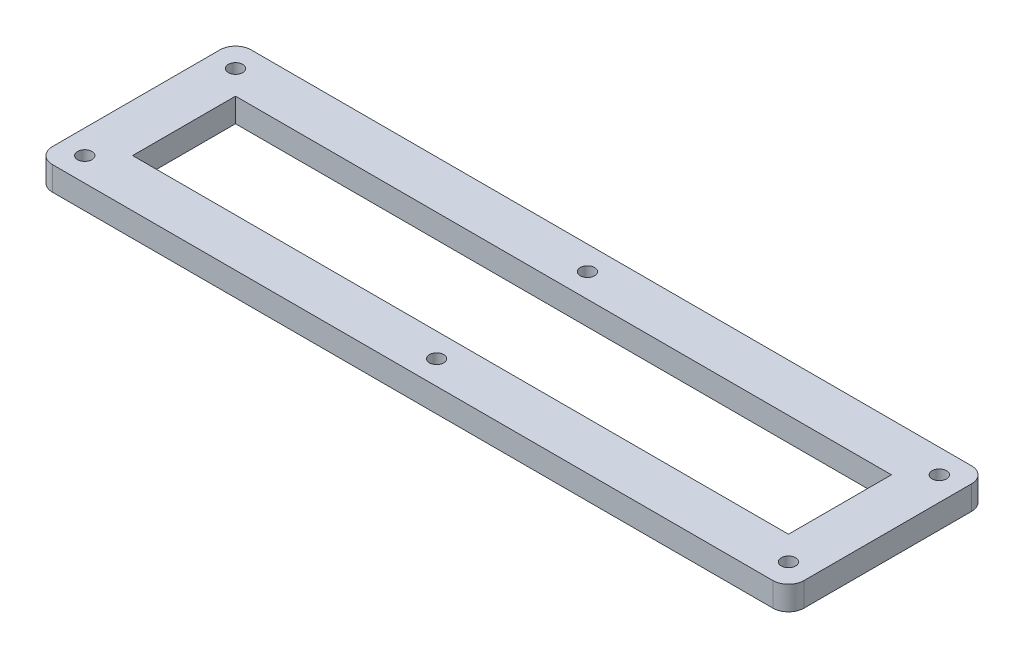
from build123d import *

# Parameters (mm, degrees)
SKETCH1_W             = 79.756
SKETCH1_H             = 42.164
PLATE_DEPTH           = 5.08
FILLET1_R             = 3.302
SKETCH3_W             = 69.596
SKETCH3_H             = 21.844
CENTERHOLE_DEPTH      = 46.392862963
SKETCH2_R             = 1.524
F_4_40THRUHOLES_DEPTH = 46.392862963
FILLET1_OF_MIRROR1_R  = 3.302


with BuildPart() as part:
    # Sketch1 → Plate (new body)
    with BuildSketch(Plane(origin=(0, 0, 0), x_dir=(1, 0, 0), z_dir=(0, 1, 0))):
        Rectangle(SKETCH1_W, SKETCH1_H)
    plate = extrude(amount=PLATE_DEPTH)

    # Fillet1
    fillet1_edges = [part.edges().sort_by_distance(p)[0] for p in [
        (-39.878, 2.54, 21.082),
        (-39.878, 2.54, -21.082),
    ]]
    fillet(fillet1_edges, radius=FILLET1_R)

    # Sketch3 → CenterHole (cut, through all)
    with BuildSketch(Plane(origin=(0, 5.08, 0), x_dir=(1, 0, 0), z_dir=(0, 1, 0))):
        with Locations((5.08, 0)):
            Rectangle(SKETCH3_W, SKETCH3_H)
    centerhole = extrude(amount=-CENTERHOLE_DEPTH, mode=Mode.SUBTRACT)

    # Sketch2 → 4-40ThruHoles (cut, through all)
    with BuildSketch(Plane(origin=(0, 5.08, 0), x_dir=(1, 0, 0), z_dir=(0, 1, 0))):
        with Locations(Location((-34.798, 16.002, 0), (0, 0, 270))):
            Circle(SKETCH2_R)
        with Locations((39.878, 16.002)):
            Circle(SKETCH2_R)
        with Locations(Location((-34.798, -16.002, 0), (0, 0, 270))):
            Circle(SKETCH2_R)
        with Locations((39.878, -16.002)):
            Circle(SKETCH2_R)
    f_4_40thruholes = extrude(amount=-F_4_40THRUHOLES_DEPTH, mode=Mode.SUBTRACT)

    # Mirror1: Plate, CenterHole, 4-40ThruHoles across plane
    add(plate.mirror(Plane(origin=(39.878, 5.08, -21.082), x_dir=(0, 0, 1), z_dir=(-1, 0, 0))))
    add(centerhole.mirror(Plane(origin=(39.878, 5.08, -21.082), x_dir=(0, 0, 1), z_dir=(-1, 0, 0))), mode=Mode.SUBTRACT)
    add(f_4_40thruholes.mirror(Plane(origin=(39.878, 5.08, -21.082), x_dir=(0, 0, 1), z_dir=(-1, 0, 0))), mode=Mode.SUBTRACT)

    # Fillet1 of Mirror1
    fillet1_of_mirror1_edges = [part.edges().sort_by_distance(p)[0] for p in [
        (119.634, 2.54, 21.082),
        (119.634, 2.54, -21.082),
    ]]
    fillet(fillet1_of_mirror1_edges, radius=FILLET1_OF_MIRROR1_R)


solid = part.part
